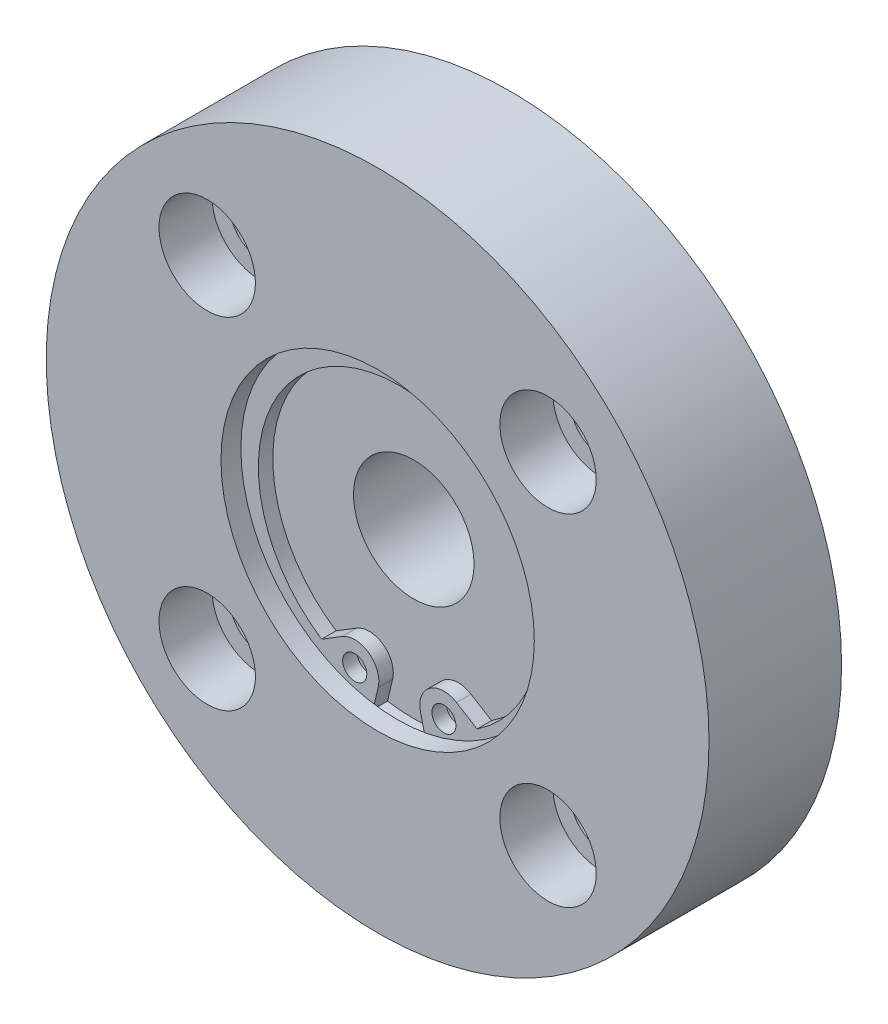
ISO-10303-21;
HEADER;
FILE_DESCRIPTION(('STEP AP214'),'2;1');
FILE_NAME('part.step','',(''),(''),'','','');
FILE_SCHEMA(('AUTOMOTIVE_DESIGN { 1 0 10303 214 1 1 1 1 }'));
ENDSEC;
DATA;
#1=APPLICATION_CONTEXT('core data for automotive mechanical design processes');
#2=APPLICATION_PROTOCOL_DEFINITION('international standard','automotive_design',2000,#1);
#3=PRODUCT_CONTEXT('',#1,'mechanical');
#4=PRODUCT('Part','Part','',(#3));
#5=PRODUCT_RELATED_PRODUCT_CATEGORY('part','',(#4));
#6=PRODUCT_DEFINITION_FORMATION('','',#4);
#7=PRODUCT_DEFINITION_CONTEXT('part definition',#1,'design');
#8=PRODUCT_DEFINITION('design','',#6,#7);
#9=PRODUCT_DEFINITION_SHAPE('','',#8);
#10=(LENGTH_UNIT() NAMED_UNIT(*) SI_UNIT(.MILLI.,.METRE.));
#11=(NAMED_UNIT(*) PLANE_ANGLE_UNIT() SI_UNIT($,.RADIAN.));
#12=(NAMED_UNIT(*) SI_UNIT($,.STERADIAN.) SOLID_ANGLE_UNIT());
#13=UNCERTAINTY_MEASURE_WITH_UNIT(LENGTH_MEASURE(1.E-05),#10,'distance_accuracy_value','');
#14=(GEOMETRIC_REPRESENTATION_CONTEXT(3) GLOBAL_UNCERTAINTY_ASSIGNED_CONTEXT((#13)) GLOBAL_UNIT_ASSIGNED_CONTEXT((#10,
#11,#12)) REPRESENTATION_CONTEXT('',''));
#15=CARTESIAN_POINT('',(0.,0.,0.));
#16=DIRECTION('',(0.,0.,1.));
#17=DIRECTION('',(1.,0.,0.));
#18=AXIS2_PLACEMENT_3D('',#15,#16,#17);
#19=CARTESIAN_POINT('',(14.1421356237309,14.142135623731,0.));
#20=DIRECTION('',(0.,0.,1.));
#21=DIRECTION('',(1.,0.,0.));
#22=AXIS2_PLACEMENT_3D('',#19,#20,#21);
#23=CYLINDRICAL_SURFACE('',#22,2.5);
#24=CARTESIAN_POINT('',(14.1421356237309,14.142135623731,0.));
#25=DIRECTION('',(0.,0.,1.));
#26=DIRECTION('',(1.,0.,0.));
#27=AXIS2_PLACEMENT_3D('',#24,#25,#26);
#28=CIRCLE('',#27,2.5);
#29=CARTESIAN_POINT('',(16.6421356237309,14.142135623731,0.));
#30=VERTEX_POINT('',#29);
#31=EDGE_CURVE('E199',#30,#30,#28,.T.);
#32=ORIENTED_EDGE('',*,*,#31,.F.);
#33=EDGE_LOOP('',(#32));
#34=FACE_BOUND('',#33,.T.);
#35=CARTESIAN_POINT('',(14.1421356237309,14.142135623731,6.6));
#36=DIRECTION('',(0.,0.,1.));
#37=DIRECTION('',(1.,0.,0.));
#38=AXIS2_PLACEMENT_3D('',#35,#36,#37);
#39=CIRCLE('',#38,2.5);
#40=CARTESIAN_POINT('',(16.6421356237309,14.142135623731,6.6));
#41=VERTEX_POINT('',#40);
#42=EDGE_CURVE('E196',#41,#41,#39,.F.);
#43=ORIENTED_EDGE('',*,*,#42,.F.);
#44=EDGE_LOOP('',(#43));
#45=FACE_BOUND('',#44,.T.);
#46=ADVANCED_FACE('F14',(#34,#45),#23,.F.);
#47=CARTESIAN_POINT('',(14.142135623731,-14.1421356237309,0.));
#48=DIRECTION('',(0.,0.,1.));
#49=DIRECTION('',(1.,0.,0.));
#50=AXIS2_PLACEMENT_3D('',#47,#48,#49);
#51=CYLINDRICAL_SURFACE('',#50,2.5);
#52=CARTESIAN_POINT('',(14.142135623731,-14.1421356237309,0.));
#53=DIRECTION('',(0.,0.,1.));
#54=DIRECTION('',(0.,-1.,0.));
#55=AXIS2_PLACEMENT_3D('',#52,#53,#54);
#56=CIRCLE('',#55,2.5);
#57=CARTESIAN_POINT('',(14.142135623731,-16.6421356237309,0.));
#58=VERTEX_POINT('',#57);
#59=EDGE_CURVE('E217',#58,#58,#56,.T.);
#60=ORIENTED_EDGE('',*,*,#59,.F.);
#61=EDGE_LOOP('',(#60));
#62=FACE_BOUND('',#61,.T.);
#63=CARTESIAN_POINT('',(14.142135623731,-14.1421356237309,6.6));
#64=DIRECTION('',(0.,0.,1.));
#65=DIRECTION('',(1.,0.,0.));
#66=AXIS2_PLACEMENT_3D('',#63,#64,#65);
#67=CIRCLE('',#66,2.5);
#68=CARTESIAN_POINT('',(16.642135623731,-14.1421356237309,6.6));
#69=VERTEX_POINT('',#68);
#70=EDGE_CURVE('E191',#69,#69,#67,.F.);
#71=ORIENTED_EDGE('',*,*,#70,.F.);
#72=EDGE_LOOP('',(#71));
#73=FACE_BOUND('',#72,.T.);
#74=ADVANCED_FACE('F320',(#62,#73),#51,.F.);
#75=CARTESIAN_POINT('',(-14.142135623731,-14.1421356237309,0.));
#76=DIRECTION('',(0.,0.,1.));
#77=DIRECTION('',(1.,0.,0.));
#78=AXIS2_PLACEMENT_3D('',#75,#76,#77);
#79=CYLINDRICAL_SURFACE('',#78,2.5);
#80=CARTESIAN_POINT('',(-14.142135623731,-14.1421356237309,0.));
#81=DIRECTION('',(0.,0.,1.));
#82=DIRECTION('',(-1.,0.,0.));
#83=AXIS2_PLACEMENT_3D('',#80,#81,#82);
#84=CIRCLE('',#83,2.5);
#85=CARTESIAN_POINT('',(-16.642135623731,-14.1421356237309,0.));
#86=VERTEX_POINT('',#85);
#87=EDGE_CURVE('E220',#86,#86,#84,.T.);
#88=ORIENTED_EDGE('',*,*,#87,.F.);
#89=EDGE_LOOP('',(#88));
#90=FACE_BOUND('',#89,.T.);
#91=CARTESIAN_POINT('',(-14.142135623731,-14.1421356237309,6.6));
#92=DIRECTION('',(0.,0.,1.));
#93=DIRECTION('',(1.,0.,0.));
#94=AXIS2_PLACEMENT_3D('',#91,#92,#93);
#95=CIRCLE('',#94,2.5);
#96=CARTESIAN_POINT('',(-11.642135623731,-14.1421356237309,6.6));
#97=VERTEX_POINT('',#96);
#98=EDGE_CURVE('E186',#97,#97,#95,.F.);
#99=ORIENTED_EDGE('',*,*,#98,.F.);
#100=EDGE_LOOP('',(#99));
#101=FACE_BOUND('',#100,.T.);
#102=ADVANCED_FACE('F313',(#90,#101),#79,.F.);
#103=CARTESIAN_POINT('',(-14.1421356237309,14.142135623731,0.));
#104=DIRECTION('',(0.,0.,1.));
#105=DIRECTION('',(1.,0.,0.));
#106=AXIS2_PLACEMENT_3D('',#103,#104,#105);
#107=CYLINDRICAL_SURFACE('',#106,2.5);
#108=CARTESIAN_POINT('',(-14.1421356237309,14.142135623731,0.));
#109=DIRECTION('',(0.,0.,1.));
#110=DIRECTION('',(0.,1.,0.));
#111=AXIS2_PLACEMENT_3D('',#108,#109,#110);
#112=CIRCLE('',#111,2.5);
#113=CARTESIAN_POINT('',(-14.1421356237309,16.642135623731,0.));
#114=VERTEX_POINT('',#113);
#115=EDGE_CURVE('E194',#114,#114,#112,.T.);
#116=ORIENTED_EDGE('',*,*,#115,.F.);
#117=EDGE_LOOP('',(#116));
#118=FACE_BOUND('',#117,.T.);
#119=CARTESIAN_POINT('',(-14.1421356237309,14.142135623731,6.6));
#120=DIRECTION('',(0.,0.,1.));
#121=DIRECTION('',(1.,0.,0.));
#122=AXIS2_PLACEMENT_3D('',#119,#120,#121);
#123=CIRCLE('',#122,2.5);
#124=CARTESIAN_POINT('',(-11.6421356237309,14.142135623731,6.6));
#125=VERTEX_POINT('',#124);
#126=EDGE_CURVE('E181',#125,#125,#123,.F.);
#127=ORIENTED_EDGE('',*,*,#126,.F.);
#128=EDGE_LOOP('',(#127));
#129=FACE_BOUND('',#128,.T.);
#130=ADVANCED_FACE('F306',(#118,#129),#107,.F.);
#131=CARTESIAN_POINT('',(0.,0.,-5.));
#132=DIRECTION('',(0.,0.,1.));
#133=DIRECTION('',(1.,0.,0.));
#134=AXIS2_PLACEMENT_3D('',#131,#132,#133);
#135=CYLINDRICAL_SURFACE('',#134,16.);
#136=CARTESIAN_POINT('',(0.,0.,-5.));
#137=DIRECTION('',(0.,0.,-1.));
#138=DIRECTION('',(-1.,0.,0.));
#139=AXIS2_PLACEMENT_3D('',#136,#137,#138);
#140=CIRCLE('',#139,16.);
#141=CARTESIAN_POINT('',(-16.,0.,-5.));
#142=VERTEX_POINT('',#141);
#143=EDGE_CURVE('E239',#142,#142,#140,.T.);
#144=ORIENTED_EDGE('',*,*,#143,.F.);
#145=EDGE_LOOP('',(#144));
#146=FACE_BOUND('',#145,.T.);
#147=CARTESIAN_POINT('',(0.,0.,0.));
#148=DIRECTION('',(0.,0.,-1.));
#149=DIRECTION('',(-1.,0.,0.));
#150=AXIS2_PLACEMENT_3D('',#147,#148,#149);
#151=CIRCLE('',#150,16.);
#152=CARTESIAN_POINT('',(-16.,0.,0.));
#153=VERTEX_POINT('',#152);
#154=EDGE_CURVE('E170',#153,#153,#151,.T.);
#155=ORIENTED_EDGE('',*,*,#154,.T.);
#156=EDGE_LOOP('',(#155));
#157=FACE_BOUND('',#156,.T.);
#158=ADVANCED_FACE('F300',(#146,#157),#135,.T.);
#159=CARTESIAN_POINT('',(0.,0.,0.));
#160=DIRECTION('',(0.,0.,1.));
#161=DIRECTION('',(1.,0.,0.));
#162=AXIS2_PLACEMENT_3D('',#159,#160,#161);
#163=PLANE('',#162);
#164=ORIENTED_EDGE('',*,*,#115,.T.);
#165=EDGE_LOOP('',(#164));
#166=FACE_BOUND('',#165,.T.);
#167=ORIENTED_EDGE('',*,*,#87,.T.);
#168=EDGE_LOOP('',(#167));
#169=FACE_BOUND('',#168,.T.);
#170=ORIENTED_EDGE('',*,*,#59,.T.);
#171=EDGE_LOOP('',(#170));
#172=FACE_BOUND('',#171,.T.);
#173=ORIENTED_EDGE('',*,*,#31,.T.);
#174=EDGE_LOOP('',(#173));
#175=FACE_BOUND('',#174,.T.);
#176=CARTESIAN_POINT('',(0.,0.,0.));
#177=DIRECTION('',(0.,0.,1.));
#178=DIRECTION('',(1.,0.,0.));
#179=AXIS2_PLACEMENT_3D('',#176,#177,#178);
#180=CIRCLE('',#179,27.5);
#181=CARTESIAN_POINT('',(27.5,0.,0.));
#182=VERTEX_POINT('',#181);
#183=EDGE_CURVE('E204',#182,#182,#180,.T.);
#184=ORIENTED_EDGE('',*,*,#183,.F.);
#185=EDGE_LOOP('',(#184));
#186=FACE_BOUND('',#185,.T.);
#187=ORIENTED_EDGE('',*,*,#154,.F.);
#188=EDGE_LOOP('',(#187));
#189=FACE_BOUND('',#188,.T.);
#190=ADVANCED_FACE('F296',(#166,#169,#172,#175,#186,#189),#163,.F.);
#191=CARTESIAN_POINT('',(14.1421356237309,14.142135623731,6.6));
#192=DIRECTION('',(0.,0.,1.));
#193=DIRECTION('',(1.,0.,0.));
#194=AXIS2_PLACEMENT_3D('',#191,#192,#193);
#195=PLANE('',#194);
#196=CARTESIAN_POINT('',(14.1421356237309,14.142135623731,6.6));
#197=DIRECTION('',(0.,0.,1.));
#198=DIRECTION('',(1.,0.,0.));
#199=AXIS2_PLACEMENT_3D('',#196,#197,#198);
#200=CIRCLE('',#199,4.);
#201=CARTESIAN_POINT('',(18.1421356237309,14.142135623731,6.6));
#202=VERTEX_POINT('',#201);
#203=EDGE_CURVE('E200',#202,#202,#200,.T.);
#204=ORIENTED_EDGE('',*,*,#203,.T.);
#205=EDGE_LOOP('',(#204));
#206=FACE_BOUND('',#205,.T.);
#207=ORIENTED_EDGE('',*,*,#42,.T.);
#208=EDGE_LOOP('',(#207));
#209=FACE_BOUND('',#208,.T.);
#210=ADVANCED_FACE('F299',(#206,#209),#195,.T.);
#211=CARTESIAN_POINT('',(14.142135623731,-14.1421356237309,6.6));
#212=DIRECTION('',(0.,0.,1.));
#213=DIRECTION('',(1.,0.,0.));
#214=AXIS2_PLACEMENT_3D('',#211,#212,#213);
#215=PLANE('',#214);
#216=CARTESIAN_POINT('',(14.142135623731,-14.1421356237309,6.6));
#217=DIRECTION('',(0.,0.,1.));
#218=DIRECTION('',(0.,-1.,0.));
#219=AXIS2_PLACEMENT_3D('',#216,#217,#218);
#220=CIRCLE('',#219,4.);
#221=CARTESIAN_POINT('',(14.142135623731,-18.1421356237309,6.6));
#222=VERTEX_POINT('',#221);
#223=EDGE_CURVE('E195',#222,#222,#220,.T.);
#224=ORIENTED_EDGE('',*,*,#223,.T.);
#225=EDGE_LOOP('',(#224));
#226=FACE_BOUND('',#225,.T.);
#227=ORIENTED_EDGE('',*,*,#70,.T.);
#228=EDGE_LOOP('',(#227));
#229=FACE_BOUND('',#228,.T.);
#230=ADVANCED_FACE('F706',(#226,#229),#215,.T.);
#231=CARTESIAN_POINT('',(-14.142135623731,-14.1421356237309,6.6));
#232=DIRECTION('',(0.,0.,1.));
#233=DIRECTION('',(1.,0.,0.));
#234=AXIS2_PLACEMENT_3D('',#231,#232,#233);
#235=PLANE('',#234);
#236=CARTESIAN_POINT('',(-14.142135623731,-14.1421356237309,6.6));
#237=DIRECTION('',(0.,0.,1.));
#238=DIRECTION('',(-1.,0.,0.));
#239=AXIS2_PLACEMENT_3D('',#236,#237,#238);
#240=CIRCLE('',#239,4.);
#241=CARTESIAN_POINT('',(-18.142135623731,-14.1421356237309,6.6));
#242=VERTEX_POINT('',#241);
#243=EDGE_CURVE('E190',#242,#242,#240,.T.);
#244=ORIENTED_EDGE('',*,*,#243,.T.);
#245=EDGE_LOOP('',(#244));
#246=FACE_BOUND('',#245,.T.);
#247=ORIENTED_EDGE('',*,*,#98,.T.);
#248=EDGE_LOOP('',(#247));
#249=FACE_BOUND('',#248,.T.);
#250=ADVANCED_FACE('F389',(#246,#249),#235,.T.);
#251=CARTESIAN_POINT('',(-14.1421356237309,14.142135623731,6.6));
#252=DIRECTION('',(0.,0.,1.));
#253=DIRECTION('',(1.,0.,0.));
#254=AXIS2_PLACEMENT_3D('',#251,#252,#253);
#255=PLANE('',#254);
#256=CARTESIAN_POINT('',(-14.1421356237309,14.142135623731,6.6));
#257=DIRECTION('',(0.,0.,1.));
#258=DIRECTION('',(0.,1.,0.));
#259=AXIS2_PLACEMENT_3D('',#256,#257,#258);
#260=CIRCLE('',#259,4.);
#261=CARTESIAN_POINT('',(-14.1421356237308,18.142135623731,6.6));
#262=VERTEX_POINT('',#261);
#263=EDGE_CURVE('E185',#262,#262,#260,.T.);
#264=ORIENTED_EDGE('',*,*,#263,.T.);
#265=EDGE_LOOP('',(#264));
#266=FACE_BOUND('',#265,.T.);
#267=ORIENTED_EDGE('',*,*,#126,.T.);
#268=EDGE_LOOP('',(#267));
#269=FACE_BOUND('',#268,.T.);
#270=ADVANCED_FACE('F384',(#266,#269),#255,.T.);
#271=CARTESIAN_POINT('',(0.,0.,-5.));
#272=DIRECTION('',(0.,0.,-1.));
#273=DIRECTION('',(-1.,0.,0.));
#274=AXIS2_PLACEMENT_3D('',#271,#272,#273);
#275=PLANE('',#274);
#276=ORIENTED_EDGE('',*,*,#143,.T.);
#277=EDGE_LOOP('',(#276));
#278=FACE_BOUND('',#277,.T.);
#279=CARTESIAN_POINT('',(0.,0.,-5.));
#280=DIRECTION('',(0.,0.,-1.));
#281=DIRECTION('',(-1.,0.,0.));
#282=AXIS2_PLACEMENT_3D('',#279,#280,#281);
#283=CIRCLE('',#282,11.);
#284=CARTESIAN_POINT('',(-11.,0.,-5.));
#285=VERTEX_POINT('',#284);
#286=EDGE_CURVE('E242',#285,#285,#283,.T.);
#287=ORIENTED_EDGE('',*,*,#286,.F.);
#288=EDGE_LOOP('',(#287));
#289=FACE_BOUND('',#288,.T.);
#290=ADVANCED_FACE('F292',(#278,#289),#275,.T.);
#291=CARTESIAN_POINT('',(0.,0.,11.));
#292=DIRECTION('',(0.,0.,-1.));
#293=DIRECTION('',(-1.,0.,0.));
#294=AXIS2_PLACEMENT_3D('',#291,#292,#293);
#295=CYLINDRICAL_SURFACE('',#294,27.5);
#296=CARTESIAN_POINT('',(0.,0.,11.));
#297=DIRECTION('',(0.,0.,1.));
#298=DIRECTION('',(1.,0.,0.));
#299=AXIS2_PLACEMENT_3D('',#296,#297,#298);
#300=CIRCLE('',#299,27.5);
#301=CARTESIAN_POINT('',(27.5,0.,11.));
#302=VERTEX_POINT('',#301);
#303=EDGE_CURVE('E201',#302,#302,#300,.T.);
#304=ORIENTED_EDGE('',*,*,#303,.F.);
#305=EDGE_LOOP('',(#304));
#306=FACE_BOUND('',#305,.T.);
#307=ORIENTED_EDGE('',*,*,#183,.T.);
#308=EDGE_LOOP('',(#307));
#309=FACE_BOUND('',#308,.T.);
#310=ADVANCED_FACE('F288',(#306,#309),#295,.T.);
#311=CARTESIAN_POINT('',(14.1421356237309,14.142135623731,6.6));
#312=DIRECTION('',(0.,0.,1.));
#313=DIRECTION('',(1.,0.,0.));
#314=AXIS2_PLACEMENT_3D('',#311,#312,#313);
#315=CYLINDRICAL_SURFACE('',#314,4.);
#316=ORIENTED_EDGE('',*,*,#203,.F.);
#317=EDGE_LOOP('',(#316));
#318=FACE_BOUND('',#317,.T.);
#319=CARTESIAN_POINT('',(14.1421356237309,14.142135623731,11.));
#320=DIRECTION('',(0.,0.,1.));
#321=DIRECTION('',(1.,0.,0.));
#322=AXIS2_PLACEMENT_3D('',#319,#320,#321);
#323=CIRCLE('',#322,4.);
#324=CARTESIAN_POINT('',(18.1421356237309,14.142135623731,11.));
#325=VERTEX_POINT('',#324);
#326=EDGE_CURVE('E214',#325,#325,#323,.T.);
#327=ORIENTED_EDGE('',*,*,#326,.T.);
#328=EDGE_LOOP('',(#327));
#329=FACE_BOUND('',#328,.T.);
#330=ADVANCED_FACE('F291',(#318,#329),#315,.F.);
#331=CARTESIAN_POINT('',(14.142135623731,-14.1421356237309,6.6));
#332=DIRECTION('',(0.,0.,1.));
#333=DIRECTION('',(1.,0.,0.));
#334=AXIS2_PLACEMENT_3D('',#331,#332,#333);
#335=CYLINDRICAL_SURFACE('',#334,4.);
#336=ORIENTED_EDGE('',*,*,#223,.F.);
#337=EDGE_LOOP('',(#336));
#338=FACE_BOUND('',#337,.T.);
#339=CARTESIAN_POINT('',(14.142135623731,-14.1421356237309,11.));
#340=DIRECTION('',(0.,0.,1.));
#341=DIRECTION('',(0.,-1.,0.));
#342=AXIS2_PLACEMENT_3D('',#339,#340,#341);
#343=CIRCLE('',#342,4.);
#344=CARTESIAN_POINT('',(14.142135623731,-18.1421356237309,11.));
#345=VERTEX_POINT('',#344);
#346=EDGE_CURVE('E189',#345,#345,#343,.T.);
#347=ORIENTED_EDGE('',*,*,#346,.T.);
#348=EDGE_LOOP('',(#347));
#349=FACE_BOUND('',#348,.T.);
#350=ADVANCED_FACE('F651',(#338,#349),#335,.F.);
#351=CARTESIAN_POINT('',(-14.142135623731,-14.1421356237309,6.6));
#352=DIRECTION('',(0.,0.,1.));
#353=DIRECTION('',(1.,0.,0.));
#354=AXIS2_PLACEMENT_3D('',#351,#352,#353);
#355=CYLINDRICAL_SURFACE('',#354,4.);
#356=ORIENTED_EDGE('',*,*,#243,.F.);
#357=EDGE_LOOP('',(#356));
#358=FACE_BOUND('',#357,.T.);
#359=CARTESIAN_POINT('',(-14.142135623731,-14.1421356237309,11.));
#360=DIRECTION('',(0.,0.,1.));
#361=DIRECTION('',(-1.,0.,0.));
#362=AXIS2_PLACEMENT_3D('',#359,#360,#361);
#363=CIRCLE('',#362,4.);
#364=CARTESIAN_POINT('',(-18.142135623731,-14.1421356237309,11.));
#365=VERTEX_POINT('',#364);
#366=EDGE_CURVE('E184',#365,#365,#363,.T.);
#367=ORIENTED_EDGE('',*,*,#366,.T.);
#368=EDGE_LOOP('',(#367));
#369=FACE_BOUND('',#368,.T.);
#370=ADVANCED_FACE('F642',(#358,#369),#355,.F.);
#371=CARTESIAN_POINT('',(-14.1421356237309,14.142135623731,6.6));
#372=DIRECTION('',(0.,0.,1.));
#373=DIRECTION('',(1.,0.,0.));
#374=AXIS2_PLACEMENT_3D('',#371,#372,#373);
#375=CYLINDRICAL_SURFACE('',#374,4.);
#376=ORIENTED_EDGE('',*,*,#263,.F.);
#377=EDGE_LOOP('',(#376));
#378=FACE_BOUND('',#377,.T.);
#379=CARTESIAN_POINT('',(-14.1421356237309,14.142135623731,11.));
#380=DIRECTION('',(0.,0.,1.));
#381=DIRECTION('',(0.,1.,0.));
#382=AXIS2_PLACEMENT_3D('',#379,#380,#381);
#383=CIRCLE('',#382,4.);
#384=CARTESIAN_POINT('',(-14.1421356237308,18.142135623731,11.));
#385=VERTEX_POINT('',#384);
#386=EDGE_CURVE('E179',#385,#385,#383,.T.);
#387=ORIENTED_EDGE('',*,*,#386,.T.);
#388=EDGE_LOOP('',(#387));
#389=FACE_BOUND('',#388,.T.);
#390=ADVANCED_FACE('F381',(#378,#389),#375,.F.);
#391=CARTESIAN_POINT('',(0.,0.,-5.));
#392=DIRECTION('',(0.,0.,1.));
#393=DIRECTION('',(1.,0.,0.));
#394=AXIS2_PLACEMENT_3D('',#391,#392,#393);
#395=CYLINDRICAL_SURFACE('',#394,11.);
#396=ORIENTED_EDGE('',*,*,#286,.T.);
#397=EDGE_LOOP('',(#396));
#398=FACE_BOUND('',#397,.T.);
#399=CARTESIAN_POINT('',(0.,0.,0.));
#400=DIRECTION('',(0.,0.,-1.));
#401=DIRECTION('',(-1.,0.,0.));
#402=AXIS2_PLACEMENT_3D('',#399,#400,#401);
#403=CIRCLE('',#402,11.);
#404=CARTESIAN_POINT('',(-11.,0.,0.));
#405=VERTEX_POINT('',#404);
#406=EDGE_CURVE('E174',#405,#405,#403,.T.);
#407=ORIENTED_EDGE('',*,*,#406,.F.);
#408=EDGE_LOOP('',(#407));
#409=FACE_BOUND('',#408,.T.);
#410=ADVANCED_FACE('F276',(#398,#409),#395,.F.);
#411=CARTESIAN_POINT('',(0.,0.,11.));
#412=DIRECTION('',(0.,0.,1.));
#413=DIRECTION('',(1.,0.,0.));
#414=AXIS2_PLACEMENT_3D('',#411,#412,#413);
#415=PLANE('',#414);
#416=CARTESIAN_POINT('',(0.,0.,11.));
#417=DIRECTION('',(0.,0.,1.));
#418=DIRECTION('',(1.,0.,0.));
#419=AXIS2_PLACEMENT_3D('',#416,#417,#418);
#420=CIRCLE('',#419,13.);
#421=CARTESIAN_POINT('',(13.,0.,11.));
#422=VERTEX_POINT('',#421);
#423=EDGE_CURVE('E180',#422,#422,#420,.T.);
#424=ORIENTED_EDGE('',*,*,#423,.F.);
#425=EDGE_LOOP('',(#424));
#426=FACE_BOUND('',#425,.T.);
#427=ORIENTED_EDGE('',*,*,#386,.F.);
#428=EDGE_LOOP('',(#427));
#429=FACE_BOUND('',#428,.T.);
#430=ORIENTED_EDGE('',*,*,#366,.F.);
#431=EDGE_LOOP('',(#430));
#432=FACE_BOUND('',#431,.T.);
#433=ORIENTED_EDGE('',*,*,#346,.F.);
#434=EDGE_LOOP('',(#433));
#435=FACE_BOUND('',#434,.T.);
#436=ORIENTED_EDGE('',*,*,#326,.F.);
#437=EDGE_LOOP('',(#436));
#438=FACE_BOUND('',#437,.T.);
#439=ORIENTED_EDGE('',*,*,#303,.T.);
#440=EDGE_LOOP('',(#439));
#441=FACE_BOUND('',#440,.T.);
#442=ADVANCED_FACE('F273',(#426,#429,#432,#435,#438,#441),#415,.T.);
#443=ORIENTED_EDGE('',*,*,#406,.T.);
#444=EDGE_LOOP('',(#443));
#445=FACE_BOUND('',#444,.T.);
#446=CARTESIAN_POINT('',(0.,0.,0.));
#447=DIRECTION('',(0.,0.,1.));
#448=DIRECTION('',(1.,0.,0.));
#449=AXIS2_PLACEMENT_3D('',#446,#447,#448);
#450=CIRCLE('',#449,5.);
#451=CARTESIAN_POINT('',(5.,0.,0.));
#452=VERTEX_POINT('',#451);
#453=EDGE_CURVE('E207',#452,#452,#450,.T.);
#454=ORIENTED_EDGE('',*,*,#453,.T.);
#455=EDGE_LOOP('',(#454));
#456=FACE_BOUND('',#455,.T.);
#457=ADVANCED_FACE('F269',(#445,#456),#163,.F.);
#458=CARTESIAN_POINT('',(0.,0.,8.));
#459=DIRECTION('',(0.,0.,1.));
#460=DIRECTION('',(1.,0.,0.));
#461=AXIS2_PLACEMENT_3D('',#458,#459,#460);
#462=CYLINDRICAL_SURFACE('',#461,13.);
#463=CARTESIAN_POINT('',(0.,0.,9.35));
#464=DIRECTION('',(0.,0.,1.));
#465=DIRECTION('',(1.,0.,0.));
#466=AXIS2_PLACEMENT_3D('',#463,#464,#465);
#467=CIRCLE('',#466,13.);
#468=CARTESIAN_POINT('',(13.,0.,9.35));
#469=VERTEX_POINT('',#468);
#470=EDGE_CURVE('E171',#469,#469,#467,.F.);
#471=ORIENTED_EDGE('',*,*,#470,.T.);
#472=EDGE_LOOP('',(#471));
#473=FACE_BOUND('',#472,.T.);
#474=ORIENTED_EDGE('',*,*,#423,.T.);
#475=EDGE_LOOP('',(#474));
#476=FACE_BOUND('',#475,.T.);
#477=ADVANCED_FACE('F265',(#473,#476),#462,.F.);
#478=CARTESIAN_POINT('',(0.,0.,11.));
#479=DIRECTION('',(0.,0.,-1.));
#480=DIRECTION('',(-1.,0.,0.));
#481=AXIS2_PLACEMENT_3D('',#478,#479,#480);
#482=CYLINDRICAL_SURFACE('',#481,5.);
#483=ORIENTED_EDGE('',*,*,#453,.F.);
#484=EDGE_LOOP('',(#483));
#485=FACE_BOUND('',#484,.T.);
#486=CARTESIAN_POINT('',(0.,0.,8.));
#487=DIRECTION('',(0.,0.,1.));
#488=DIRECTION('',(1.,0.,0.));
#489=AXIS2_PLACEMENT_3D('',#486,#487,#488);
#490=CIRCLE('',#489,5.);
#491=CARTESIAN_POINT('',(5.,0.,8.));
#492=VERTEX_POINT('',#491);
#493=EDGE_CURVE('E176',#492,#492,#490,.T.);
#494=ORIENTED_EDGE('',*,*,#493,.T.);
#495=EDGE_LOOP('',(#494));
#496=FACE_BOUND('',#495,.T.);
#497=ADVANCED_FACE('F268',(#485,#496),#482,.F.);
#498=CARTESIAN_POINT('',(0.,0.,8.));
#499=DIRECTION('',(0.,0.,1.));
#500=DIRECTION('',(1.,0.,0.));
#501=AXIS2_PLACEMENT_3D('',#498,#499,#500);
#502=PLANE('',#501);
#503=ORIENTED_EDGE('',*,*,#493,.F.);
#504=EDGE_LOOP('',(#503));
#505=FACE_BOUND('',#504,.T.);
#506=CARTESIAN_POINT('',(0.,0.,8.));
#507=DIRECTION('',(0.,0.,1.));
#508=DIRECTION('',(1.,0.,0.));
#509=AXIS2_PLACEMENT_3D('',#506,#507,#508);
#510=CIRCLE('',#509,13.6);
#511=CARTESIAN_POINT('',(-2.18133072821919,-13.4239262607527,8.));
#512=VERTEX_POINT('',#511);
#513=CARTESIAN_POINT('',(2.1813307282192,-13.4239262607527,8.));
#514=VERTEX_POINT('',#513);
#515=EDGE_CURVE('E249',#512,#514,#510,.T.);
#516=ORIENTED_EDGE('',*,*,#515,.T.);
#517=DIRECTION('',(-0.231349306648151,0.972870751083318,0.));
#518=VECTOR('',#517,1.);
#519=CARTESIAN_POINT('',(-0.956782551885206,-0.227523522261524,8.));
#520=LINE('',#519,#518);
#521=CARTESIAN_POINT('',(1.75425849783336,-11.6280009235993,8.));
#522=VERTEX_POINT('',#521);
#523=EDGE_CURVE('E9',#514,#522,#520,.T.);
#524=ORIENTED_EDGE('',*,*,#523,.T.);
#525=CARTESIAN_POINT('',(3.7,-11.165302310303,8.));
#526=DIRECTION('',(0.,0.,1.));
#527=DIRECTION('',(1.,0.,0.));
#528=AXIS2_PLACEMENT_3D('',#525,#526,#527);
#529=CIRCLE('',#528,2.);
#530=CARTESIAN_POINT('',(4.74866968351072,-9.46227797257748,8.));
#531=VERTEX_POINT('',#530);
#532=EDGE_CURVE('E25',#531,#522,#529,.T.);
#533=ORIENTED_EDGE('',*,*,#532,.F.);
#534=DIRECTION('',(0.851512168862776,-0.524334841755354,0.));
#535=VECTOR('',#534,1.);
#536=CARTESIAN_POINT('',(-2.91915656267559,-4.74066786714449,8.));
#537=LINE('',#536,#535);
#538=CARTESIAN_POINT('',(6.45127454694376,-10.5106893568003,8.));
#539=VERTEX_POINT('',#538);
#540=EDGE_CURVE('E138',#531,#539,#537,.T.);
#541=ORIENTED_EDGE('',*,*,#540,.T.);
#542=CARTESIAN_POINT('',(0.,-0.75,8.));
#543=DIRECTION('',(0.,0.,1.));
#544=DIRECTION('',(1.,0.,0.));
#545=AXIS2_PLACEMENT_3D('',#542,#543,#544);
#546=CIRCLE('',#545,11.7);
#547=CARTESIAN_POINT('',(-6.45127454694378,-10.5106893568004,8.));
#548=VERTEX_POINT('',#547);
#549=EDGE_CURVE('E142',#539,#548,#546,.T.);
#550=ORIENTED_EDGE('',*,*,#549,.T.);
#551=DIRECTION('',(0.851512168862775,0.524334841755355,0.));
#552=VECTOR('',#551,1.);
#553=CARTESIAN_POINT('',(2.91915656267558,-4.74066786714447,8.));
#554=LINE('',#553,#552);
#555=CARTESIAN_POINT('',(-4.74866968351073,-9.46227797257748,8.));
#556=VERTEX_POINT('',#555);
#557=EDGE_CURVE('E146',#548,#556,#554,.T.);
#558=ORIENTED_EDGE('',*,*,#557,.T.);
#559=CARTESIAN_POINT('',(-3.7,-11.165302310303,8.));
#560=DIRECTION('',(0.,0.,1.));
#561=DIRECTION('',(1.,0.,0.));
#562=AXIS2_PLACEMENT_3D('',#559,#560,#561);
#563=CIRCLE('',#562,2.);
#564=CARTESIAN_POINT('',(-1.75425849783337,-11.6280009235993,8.));
#565=VERTEX_POINT('',#564);
#566=EDGE_CURVE('E153',#565,#556,#563,.T.);
#567=ORIENTED_EDGE('',*,*,#566,.F.);
#568=DIRECTION('',(-0.231349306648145,-0.97287075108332,0.));
#569=VECTOR('',#568,1.);
#570=CARTESIAN_POINT('',(0.956782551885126,-0.227523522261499,8.));
#571=LINE('',#570,#569);
#572=EDGE_CURVE('E150',#565,#512,#571,.T.);
#573=ORIENTED_EDGE('',*,*,#572,.T.);
#574=EDGE_LOOP('',(#516,#524,#533,#541,#550,#558,#567,#573));
#575=FACE_BOUND('',#574,.T.);
#576=ADVANCED_FACE('F261',(#505,#575),#502,.T.);
#577=CARTESIAN_POINT('',(0.,0.,9.35));
#578=DIRECTION('',(0.,0.,1.));
#579=DIRECTION('',(1.,0.,0.));
#580=AXIS2_PLACEMENT_3D('',#577,#578,#579);
#581=PLANE('',#580);
#582=CARTESIAN_POINT('',(0.,0.,9.35));
#583=DIRECTION('',(0.,0.,1.));
#584=DIRECTION('',(1.,0.,0.));
#585=AXIS2_PLACEMENT_3D('',#582,#583,#584);
#586=CIRCLE('',#585,13.6);
#587=CARTESIAN_POINT('',(13.6,0.,9.35));
#588=VERTEX_POINT('',#587);
#589=EDGE_CURVE('E175',#588,#588,#586,.T.);
#590=ORIENTED_EDGE('',*,*,#589,.F.);
#591=EDGE_LOOP('',(#590));
#592=FACE_BOUND('',#591,.T.);
#593=ORIENTED_EDGE('',*,*,#470,.F.);
#594=EDGE_LOOP('',(#593));
#595=FACE_BOUND('',#594,.T.);
#596=ADVANCED_FACE('F258',(#592,#595),#581,.F.);
#597=CARTESIAN_POINT('',(0.,0.,9.35));
#598=DIRECTION('',(0.,0.,-1.));
#599=DIRECTION('',(-1.,0.,0.));
#600=AXIS2_PLACEMENT_3D('',#597,#598,#599);
#601=CYLINDRICAL_SURFACE('',#600,13.6);
#602=ORIENTED_EDGE('',*,*,#589,.T.);
#603=EDGE_LOOP('',(#602));
#604=FACE_BOUND('',#603,.T.);
#605=CARTESIAN_POINT('',(0.,0.,9.2));
#606=DIRECTION('',(0.,0.,-1.));
#607=DIRECTION('',(-1.,0.,0.));
#608=AXIS2_PLACEMENT_3D('',#605,#606,#607);
#609=CIRCLE('',#608,13.6);
#610=CARTESIAN_POINT('',(-2.18133072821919,-13.4239262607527,9.2));
#611=VERTEX_POINT('',#610);
#612=CARTESIAN_POINT('',(2.1813307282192,-13.4239262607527,9.2));
#613=VERTEX_POINT('',#612);
#614=EDGE_CURVE('E165',#611,#613,#609,.T.);
#615=ORIENTED_EDGE('',*,*,#614,.T.);
#616=DIRECTION('',(0.,0.,-1.));
#617=VECTOR('',#616,1.);
#618=CARTESIAN_POINT('',(2.18133072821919,-13.4239262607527,9.35));
#619=LINE('',#618,#617);
#620=EDGE_CURVE('E84',#613,#514,#619,.T.);
#621=ORIENTED_EDGE('',*,*,#620,.T.);
#622=ORIENTED_EDGE('',*,*,#515,.F.);
#623=DIRECTION('',(0.,0.,-1.));
#624=VECTOR('',#623,1.);
#625=CARTESIAN_POINT('',(-2.18133072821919,-13.4239262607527,9.35));
#626=LINE('',#625,#624);
#627=EDGE_CURVE('E167',#512,#611,#626,.F.);
#628=ORIENTED_EDGE('',*,*,#627,.T.);
#629=EDGE_LOOP('',(#615,#621,#622,#628));
#630=FACE_BOUND('',#629,.T.);
#631=ADVANCED_FACE('F255',(#604,#630),#601,.F.);
#632=CARTESIAN_POINT('',(3.7,-11.165302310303,8.));
#633=DIRECTION('',(0.,0.,1.));
#634=DIRECTION('',(1.,0.,0.));
#635=AXIS2_PLACEMENT_3D('',#632,#633,#634);
#636=CIRCLE('',#635,1.);
#637=CARTESIAN_POINT('',(4.7,-11.165302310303,8.));
#638=VERTEX_POINT('',#637);
#639=EDGE_CURVE('E161',#638,#638,#636,.T.);
#640=ORIENTED_EDGE('',*,*,#639,.T.);
#641=EDGE_LOOP('',(#640));
#642=FACE_BOUND('',#641,.T.);
#643=ADVANCED_FACE('F353',(#642),#502,.T.);
#644=CARTESIAN_POINT('',(-3.7,-11.165302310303,8.));
#645=DIRECTION('',(0.,0.,1.));
#646=DIRECTION('',(1.,0.,0.));
#647=AXIS2_PLACEMENT_3D('',#644,#645,#646);
#648=CIRCLE('',#647,1.);
#649=CARTESIAN_POINT('',(-2.7,-11.165302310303,8.));
#650=VERTEX_POINT('',#649);
#651=EDGE_CURVE('E157',#650,#650,#648,.T.);
#652=ORIENTED_EDGE('',*,*,#651,.T.);
#653=EDGE_LOOP('',(#652));
#654=FACE_BOUND('',#653,.T.);
#655=ADVANCED_FACE('F363',(#654),#502,.T.);
#656=CARTESIAN_POINT('',(4.74866968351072,-9.46227797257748,9.2));
#657=DIRECTION('',(-0.524334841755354,-0.851512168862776,0.));
#658=DIRECTION('',(-0.851512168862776,0.524334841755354,0.));
#659=AXIS2_PLACEMENT_3D('',#656,#657,#658);
#660=PLANE('',#659);
#661=ORIENTED_EDGE('',*,*,#540,.F.);
#662=DIRECTION('',(0.,0.,-1.));
#663=VECTOR('',#662,1.);
#664=CARTESIAN_POINT('',(4.74866968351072,-9.46227797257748,9.2));
#665=LINE('',#664,#663);
#666=CARTESIAN_POINT('',(4.74866968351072,-9.46227797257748,9.2));
#667=VERTEX_POINT('',#666);
#668=EDGE_CURVE('E98',#667,#531,#665,.T.);
#669=ORIENTED_EDGE('',*,*,#668,.F.);
#670=DIRECTION('',(-0.851512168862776,0.524334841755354,0.));
#671=VECTOR('',#670,1.);
#672=CARTESIAN_POINT('',(4.74866968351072,-9.46227797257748,9.2));
#673=LINE('',#672,#671);
#674=CARTESIAN_POINT('',(6.45127454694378,-10.5106893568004,9.2));
#675=VERTEX_POINT('',#674);
#676=EDGE_CURVE('E93',#675,#667,#673,.T.);
#677=ORIENTED_EDGE('',*,*,#676,.F.);
#678=DIRECTION('',(0.,0.,-1.));
#679=VECTOR('',#678,1.);
#680=CARTESIAN_POINT('',(6.45127454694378,-10.5106893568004,9.2));
#681=LINE('',#680,#679);
#682=EDGE_CURVE('E122',#675,#539,#681,.T.);
#683=ORIENTED_EDGE('',*,*,#682,.T.);
#684=EDGE_LOOP('',(#661,#669,#677,#683));
#685=FACE_BOUND('',#684,.T.);
#686=ADVANCED_FACE('F341',(#685),#660,.F.);
#687=CARTESIAN_POINT('',(0.,-0.75,9.2));
#688=DIRECTION('',(0.,0.,1.));
#689=DIRECTION('',(-1.,0.,0.));
#690=AXIS2_PLACEMENT_3D('',#687,#688,#689);
#691=CYLINDRICAL_SURFACE('',#690,11.7);
#692=ORIENTED_EDGE('',*,*,#549,.F.);
#693=ORIENTED_EDGE('',*,*,#682,.F.);
#694=CARTESIAN_POINT('',(0.,-0.75,9.2));
#695=DIRECTION('',(0.,0.,-1.));
#696=DIRECTION('',(0.,-1.,0.));
#697=AXIS2_PLACEMENT_3D('',#694,#695,#696);
#698=CIRCLE('',#697,11.7);
#699=CARTESIAN_POINT('',(-6.45127454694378,-10.5106893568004,9.2));
#700=VERTEX_POINT('',#699);
#701=EDGE_CURVE('E125',#700,#675,#698,.T.);
#702=ORIENTED_EDGE('',*,*,#701,.F.);
#703=DIRECTION('',(0.,0.,-1.));
#704=VECTOR('',#703,1.);
#705=CARTESIAN_POINT('',(-6.45127454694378,-10.5106893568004,9.2));
#706=LINE('',#705,#704);
#707=EDGE_CURVE('E118',#700,#548,#706,.T.);
#708=ORIENTED_EDGE('',*,*,#707,.T.);
#709=EDGE_LOOP('',(#692,#693,#702,#708));
#710=FACE_BOUND('',#709,.T.);
#711=ADVANCED_FACE('F16',(#710),#691,.F.);
#712=CARTESIAN_POINT('',(-4.74866968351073,-9.46227797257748,9.2));
#713=DIRECTION('',(0.524334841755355,-0.851512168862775,0.));
#714=DIRECTION('',(0.,0.,-1.));
#715=AXIS2_PLACEMENT_3D('',#712,#713,#714);
#716=PLANE('',#715);
#717=ORIENTED_EDGE('',*,*,#557,.F.);
#718=ORIENTED_EDGE('',*,*,#707,.F.);
#719=DIRECTION('',(-0.851512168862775,-0.524334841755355,0.));
#720=VECTOR('',#719,1.);
#721=CARTESIAN_POINT('',(-4.74866968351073,-9.46227797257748,9.2));
#722=LINE('',#721,#720);
#723=CARTESIAN_POINT('',(-4.74866968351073,-9.46227797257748,9.2));
#724=VERTEX_POINT('',#723);
#725=EDGE_CURVE('E126',#724,#700,#722,.T.);
#726=ORIENTED_EDGE('',*,*,#725,.F.);
#727=DIRECTION('',(0.,0.,-1.));
#728=VECTOR('',#727,1.);
#729=CARTESIAN_POINT('',(-4.74866968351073,-9.46227797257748,9.2));
#730=LINE('',#729,#728);
#731=EDGE_CURVE('E18',#724,#556,#730,.T.);
#732=ORIENTED_EDGE('',*,*,#731,.T.);
#733=EDGE_LOOP('',(#717,#718,#726,#732));
#734=FACE_BOUND('',#733,.T.);
#735=ADVANCED_FACE('F359',(#734),#716,.F.);
#736=CARTESIAN_POINT('',(-3.7,-11.165302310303,9.2));
#737=DIRECTION('',(0.,0.,1.));
#738=DIRECTION('',(-1.,0.,0.));
#739=AXIS2_PLACEMENT_3D('',#736,#737,#738);
#740=CYLINDRICAL_SURFACE('',#739,1.);
#741=ORIENTED_EDGE('',*,*,#651,.F.);
#742=EDGE_LOOP('',(#741));
#743=FACE_BOUND('',#742,.T.);
#744=CARTESIAN_POINT('',(-3.7,-11.165302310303,9.2));
#745=DIRECTION('',(0.,0.,-1.));
#746=DIRECTION('',(1.,0.,0.));
#747=AXIS2_PLACEMENT_3D('',#744,#745,#746);
#748=CIRCLE('',#747,1.);
#749=CARTESIAN_POINT('',(-2.7,-11.165302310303,9.2));
#750=VERTEX_POINT('',#749);
#751=EDGE_CURVE('E103',#750,#750,#748,.T.);
#752=ORIENTED_EDGE('',*,*,#751,.F.);
#753=EDGE_LOOP('',(#752));
#754=FACE_BOUND('',#753,.T.);
#755=ADVANCED_FACE('F351',(#743,#754),#740,.F.);
#756=CARTESIAN_POINT('',(3.7,-11.165302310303,9.2));
#757=DIRECTION('',(0.,0.,1.));
#758=DIRECTION('',(-1.,0.,0.));
#759=AXIS2_PLACEMENT_3D('',#756,#757,#758);
#760=CYLINDRICAL_SURFACE('',#759,1.);
#761=ORIENTED_EDGE('',*,*,#639,.F.);
#762=EDGE_LOOP('',(#761));
#763=FACE_BOUND('',#762,.T.);
#764=CARTESIAN_POINT('',(3.7,-11.165302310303,9.2));
#765=DIRECTION('',(0.,0.,1.));
#766=DIRECTION('',(1.,0.,0.));
#767=AXIS2_PLACEMENT_3D('',#764,#765,#766);
#768=CIRCLE('',#767,1.);
#769=CARTESIAN_POINT('',(4.7,-11.165302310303,9.2));
#770=VERTEX_POINT('',#769);
#771=EDGE_CURVE('E106',#770,#770,#768,.T.);
#772=ORIENTED_EDGE('',*,*,#771,.T.);
#773=EDGE_LOOP('',(#772));
#774=FACE_BOUND('',#773,.T.);
#775=ADVANCED_FACE('F340',(#763,#774),#760,.F.);
#776=CARTESIAN_POINT('',(3.7,-11.165302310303,9.2));
#777=DIRECTION('',(0.,0.,1.));
#778=DIRECTION('',(-1.,0.,0.));
#779=AXIS2_PLACEMENT_3D('',#776,#777,#778);
#780=CYLINDRICAL_SURFACE('',#779,2.);
#781=ORIENTED_EDGE('',*,*,#532,.T.);
#782=DIRECTION('',(0.,0.,-1.));
#783=VECTOR('',#782,1.);
#784=CARTESIAN_POINT('',(1.75425849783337,-11.6280009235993,9.2));
#785=LINE('',#784,#783);
#786=CARTESIAN_POINT('',(1.75425849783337,-11.6280009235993,9.2));
#787=VERTEX_POINT('',#786);
#788=EDGE_CURVE('E81',#787,#522,#785,.T.);
#789=ORIENTED_EDGE('',*,*,#788,.F.);
#790=CARTESIAN_POINT('',(3.7,-11.165302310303,9.2));
#791=DIRECTION('',(0.,0.,1.));
#792=DIRECTION('',(1.,0.,0.));
#793=AXIS2_PLACEMENT_3D('',#790,#791,#792);
#794=CIRCLE('',#793,2.);
#795=EDGE_CURVE('E87',#667,#787,#794,.T.);
#796=ORIENTED_EDGE('',*,*,#795,.F.);
#797=ORIENTED_EDGE('',*,*,#668,.T.);
#798=EDGE_LOOP('',(#781,#789,#796,#797));
#799=FACE_BOUND('',#798,.T.);
#800=ADVANCED_FACE('F96',(#799),#780,.T.);
#801=CARTESIAN_POINT('',(0.,-0.75,9.2));
#802=DIRECTION('',(0.,0.,-1.));
#803=DIRECTION('',(0.,-1.,0.));
#804=AXIS2_PLACEMENT_3D('',#801,#802,#803);
#805=PLANE('',#804);
#806=ORIENTED_EDGE('',*,*,#771,.F.);
#807=EDGE_LOOP('',(#806));
#808=FACE_BOUND('',#807,.T.);
#809=ORIENTED_EDGE('',*,*,#751,.T.);
#810=EDGE_LOOP('',(#809));
#811=FACE_BOUND('',#810,.T.);
#812=ORIENTED_EDGE('',*,*,#614,.F.);
#813=DIRECTION('',(0.231349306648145,0.97287075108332,0.));
#814=VECTOR('',#813,1.);
#815=CARTESIAN_POINT('',(-1.75425849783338,-11.6280009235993,9.2));
#816=LINE('',#815,#814);
#817=CARTESIAN_POINT('',(-1.75425849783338,-11.6280009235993,9.2));
#818=VERTEX_POINT('',#817);
#819=EDGE_CURVE('E69',#611,#818,#816,.T.);
#820=ORIENTED_EDGE('',*,*,#819,.T.);
#821=CARTESIAN_POINT('',(-3.7,-11.165302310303,9.2));
#822=DIRECTION('',(0.,0.,1.));
#823=DIRECTION('',(-1.,0.,0.));
#824=AXIS2_PLACEMENT_3D('',#821,#822,#823);
#825=CIRCLE('',#824,2.);
#826=EDGE_CURVE('E111',#818,#724,#825,.T.);
#827=ORIENTED_EDGE('',*,*,#826,.T.);
#828=ORIENTED_EDGE('',*,*,#725,.T.);
#829=ORIENTED_EDGE('',*,*,#701,.T.);
#830=ORIENTED_EDGE('',*,*,#676,.T.);
#831=ORIENTED_EDGE('',*,*,#795,.T.);
#832=DIRECTION('',(0.231349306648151,-0.972870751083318,0.));
#833=VECTOR('',#832,1.);
#834=CARTESIAN_POINT('',(1.75425849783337,-11.6280009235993,9.2));
#835=LINE('',#834,#833);
#836=EDGE_CURVE('E77',#787,#613,#835,.T.);
#837=ORIENTED_EDGE('',*,*,#836,.T.);
#838=EDGE_LOOP('',(#812,#820,#827,#828,#829,#830,#831,#837));
#839=FACE_BOUND('',#838,.T.);
#840=ADVANCED_FACE('F91',(#808,#811,#839),#805,.F.);
#841=CARTESIAN_POINT('',(-3.7,-11.165302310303,9.2));
#842=DIRECTION('',(0.,0.,1.));
#843=DIRECTION('',(-1.,0.,0.));
#844=AXIS2_PLACEMENT_3D('',#841,#842,#843);
#845=CYLINDRICAL_SURFACE('',#844,2.);
#846=ORIENTED_EDGE('',*,*,#566,.T.);
#847=ORIENTED_EDGE('',*,*,#731,.F.);
#848=ORIENTED_EDGE('',*,*,#826,.F.);
#849=DIRECTION('',(0.,0.,-1.));
#850=VECTOR('',#849,1.);
#851=CARTESIAN_POINT('',(-1.75425849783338,-11.6280009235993,9.2));
#852=LINE('',#851,#850);
#853=EDGE_CURVE('E99',#818,#565,#852,.T.);
#854=ORIENTED_EDGE('',*,*,#853,.T.);
#855=EDGE_LOOP('',(#846,#847,#848,#854));
#856=FACE_BOUND('',#855,.T.);
#857=ADVANCED_FACE('F347',(#856),#845,.T.);
#858=CARTESIAN_POINT('',(-1.75425849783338,-11.6280009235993,9.2));
#859=DIRECTION('',(-0.97287075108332,0.231349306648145,0.));
#860=DIRECTION('',(0.,0.,1.));
#861=AXIS2_PLACEMENT_3D('',#858,#859,#860);
#862=PLANE('',#861);
#863=ORIENTED_EDGE('',*,*,#627,.F.);
#864=ORIENTED_EDGE('',*,*,#572,.F.);
#865=ORIENTED_EDGE('',*,*,#853,.F.);
#866=ORIENTED_EDGE('',*,*,#819,.F.);
#867=EDGE_LOOP('',(#863,#864,#865,#866));
#868=FACE_BOUND('',#867,.T.);
#869=ADVANCED_FACE('F344',(#868),#862,.F.);
#870=CARTESIAN_POINT('',(1.75425849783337,-11.6280009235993,9.2));
#871=DIRECTION('',(0.972870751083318,0.231349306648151,0.));
#872=DIRECTION('',(0.,0.,-1.));
#873=AXIS2_PLACEMENT_3D('',#870,#871,#872);
#874=PLANE('',#873);
#875=ORIENTED_EDGE('',*,*,#620,.F.);
#876=ORIENTED_EDGE('',*,*,#836,.F.);
#877=ORIENTED_EDGE('',*,*,#788,.T.);
#878=ORIENTED_EDGE('',*,*,#523,.F.);
#879=EDGE_LOOP('',(#875,#876,#877,#878));
#880=FACE_BOUND('',#879,.T.);
#881=ADVANCED_FACE('F79',(#880),#874,.F.);
#882=CLOSED_SHELL('',(#46,#74,#102,#130,#158,#190,#210,#230,#250,#270,#290,#310,#330,#350,#370,
#390,#410,#442,#457,#477,#497,#576,#596,#631,#643,#655,#686,#711,#735,#755,#775,#800,#840,#857,
#869,#881));
#883=MANIFOLD_SOLID_BREP('B1',#882);
#884=ADVANCED_BREP_SHAPE_REPRESENTATION('',(#18,#883),#14);
#885=SHAPE_DEFINITION_REPRESENTATION(#9,#884);
ENDSEC;
END-ISO-10303-21;
